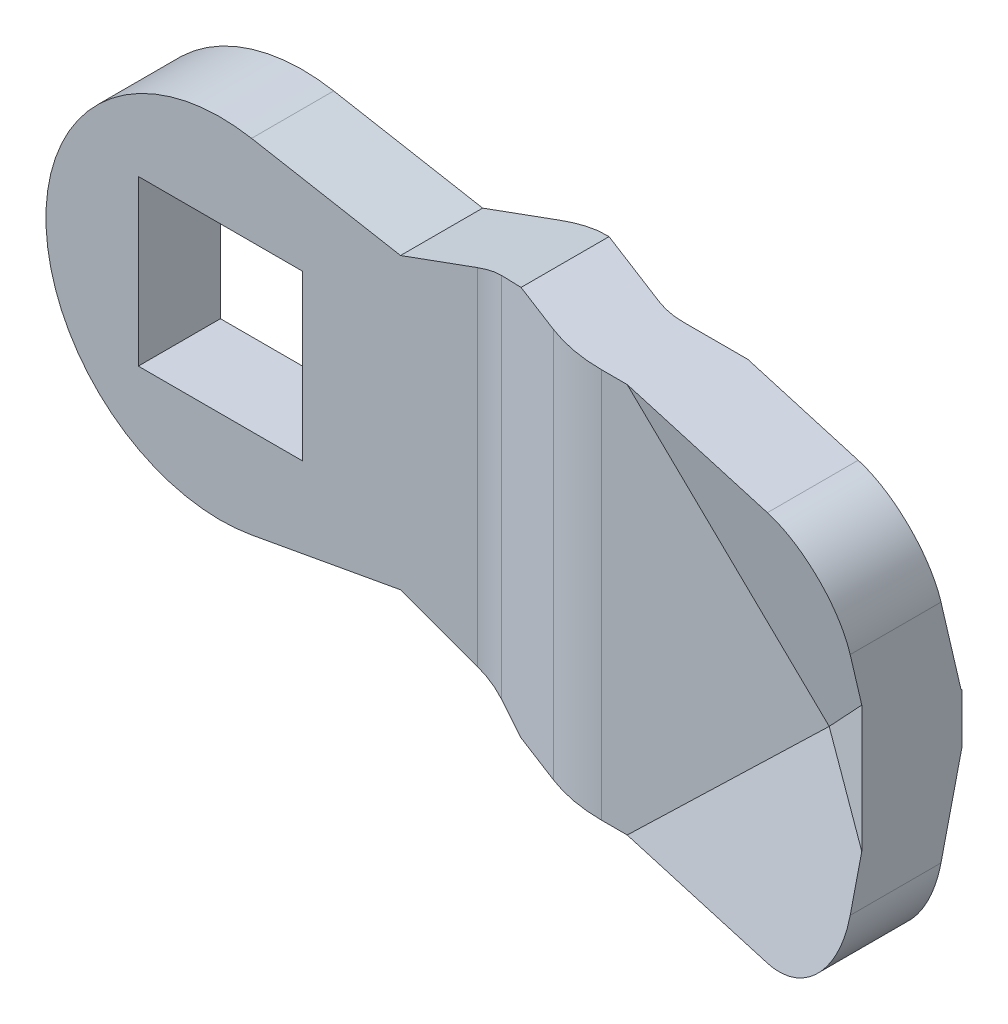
ISO-10303-21;
HEADER;
FILE_DESCRIPTION(('STEP AP214'),'2;1');
FILE_NAME('part.step','',(''),(''),'','','');
FILE_SCHEMA(('AUTOMOTIVE_DESIGN { 1 0 10303 214 1 1 1 1 }'));
ENDSEC;
DATA;
#1=APPLICATION_CONTEXT('core data for automotive mechanical design processes');
#2=APPLICATION_PROTOCOL_DEFINITION('international standard','automotive_design',2000,#1);
#3=PRODUCT_CONTEXT('',#1,'mechanical');
#4=PRODUCT('Part','Part','',(#3));
#5=PRODUCT_RELATED_PRODUCT_CATEGORY('part','',(#4));
#6=PRODUCT_DEFINITION_FORMATION('','',#4);
#7=PRODUCT_DEFINITION_CONTEXT('part definition',#1,'design');
#8=PRODUCT_DEFINITION('design','',#6,#7);
#9=PRODUCT_DEFINITION_SHAPE('','',#8);
#10=(LENGTH_UNIT() NAMED_UNIT(*) SI_UNIT(.MILLI.,.METRE.));
#11=(NAMED_UNIT(*) PLANE_ANGLE_UNIT() SI_UNIT($,.RADIAN.));
#12=(NAMED_UNIT(*) SI_UNIT($,.STERADIAN.) SOLID_ANGLE_UNIT());
#13=UNCERTAINTY_MEASURE_WITH_UNIT(LENGTH_MEASURE(1.E-05),#10,'distance_accuracy_value','');
#14=(GEOMETRIC_REPRESENTATION_CONTEXT(3) GLOBAL_UNCERTAINTY_ASSIGNED_CONTEXT((#13)) GLOBAL_UNIT_ASSIGNED_CONTEXT((#10,
#11,#12)) REPRESENTATION_CONTEXT('',''));
#15=CARTESIAN_POINT('',(0.,0.,0.));
#16=DIRECTION('',(0.,0.,1.));
#17=DIRECTION('',(1.,0.,0.));
#18=AXIS2_PLACEMENT_3D('',#15,#16,#17);
#19=CARTESIAN_POINT('',(6.5,2.8,-2.4));
#20=DIRECTION('',(0.,-1.,0.));
#21=DIRECTION('',(-1.,0.,0.));
#22=AXIS2_PLACEMENT_3D('',#19,#20,#21);
#23=PLANE('',#22);
#24=DIRECTION('',(0.707106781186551,0.,0.707106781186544));
#25=VECTOR('',#24,1.);
#26=CARTESIAN_POINT('',(7.5,2.8,-3.4));
#27=LINE('',#26,#25);
#28=CARTESIAN_POINT('',(8.5,2.8,-2.4));
#29=VERTEX_POINT('',#28);
#30=CARTESIAN_POINT('',(10.5,2.8,-0.400000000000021));
#31=VERTEX_POINT('',#30);
#32=EDGE_CURVE('E227',#29,#31,#27,.T.);
#33=ORIENTED_EDGE('',*,*,#32,.F.);
#34=DIRECTION('',(1.,0.,0.));
#35=VECTOR('',#34,1.);
#36=CARTESIAN_POINT('',(6.5,2.8,-2.4));
#37=LINE('',#36,#35);
#38=CARTESIAN_POINT('',(6.5,2.8,-2.4));
#39=VERTEX_POINT('',#38);
#40=EDGE_CURVE('E250',#39,#29,#37,.T.);
#41=ORIENTED_EDGE('',*,*,#40,.F.);
#42=DIRECTION('',(0.,0.,1.));
#43=VECTOR('',#42,1.);
#44=CARTESIAN_POINT('',(6.5,2.8,-2.4));
#45=LINE('',#44,#43);
#46=CARTESIAN_POINT('',(6.5,2.8,0.));
#47=VERTEX_POINT('',#46);
#48=EDGE_CURVE('E248',#39,#47,#45,.T.);
#49=ORIENTED_EDGE('',*,*,#48,.T.);
#50=DIRECTION('',(1.,0.,0.));
#51=VECTOR('',#50,1.);
#52=CARTESIAN_POINT('',(6.5,2.8,0.));
#53=LINE('',#52,#51);
#54=CARTESIAN_POINT('',(10.5,2.8,0.));
#55=VERTEX_POINT('',#54);
#56=EDGE_CURVE('E898',#47,#55,#53,.T.);
#57=ORIENTED_EDGE('',*,*,#56,.T.);
#58=DIRECTION('',(0.,0.,1.));
#59=VECTOR('',#58,1.);
#60=CARTESIAN_POINT('',(10.5,2.8,-2.4));
#61=LINE('',#60,#59);
#62=EDGE_CURVE('E245',#31,#55,#61,.T.);
#63=ORIENTED_EDGE('',*,*,#62,.F.);
#64=EDGE_LOOP('',(#33,#41,#49,#57,#63));
#65=FACE_BOUND('',#64,.T.);
#66=ADVANCED_FACE('F14',(#65),#23,.F.);
#67=CARTESIAN_POINT('',(10.5,-2.8,-2.4));
#68=DIRECTION('',(1.,0.,0.));
#69=DIRECTION('',(0.,-1.,0.));
#70=AXIS2_PLACEMENT_3D('',#67,#68,#69);
#71=PLANE('',#70);
#72=DIRECTION('',(0.,0.,1.));
#73=VECTOR('',#72,1.);
#74=CARTESIAN_POINT('',(10.5,-2.8,-2.4));
#75=LINE('',#74,#73);
#76=CARTESIAN_POINT('',(10.5,-2.8,-0.400000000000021));
#77=VERTEX_POINT('',#76);
#78=CARTESIAN_POINT('',(10.5,-2.8,0.));
#79=VERTEX_POINT('',#78);
#80=EDGE_CURVE('E237',#77,#79,#75,.T.);
#81=ORIENTED_EDGE('',*,*,#80,.F.);
#82=DIRECTION('',(0.,-1.,0.));
#83=VECTOR('',#82,1.);
#84=CARTESIAN_POINT('',(10.5,9.5,-0.400000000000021));
#85=LINE('',#84,#83);
#86=EDGE_CURVE('E224',#31,#77,#85,.T.);
#87=ORIENTED_EDGE('',*,*,#86,.F.);
#88=ORIENTED_EDGE('',*,*,#62,.T.);
#89=DIRECTION('',(0.,1.,0.));
#90=VECTOR('',#89,1.);
#91=CARTESIAN_POINT('',(10.5,-2.8,0.));
#92=LINE('',#91,#90);
#93=EDGE_CURVE('E244',#79,#55,#92,.T.);
#94=ORIENTED_EDGE('',*,*,#93,.F.);
#95=EDGE_LOOP('',(#81,#87,#88,#94));
#96=FACE_BOUND('',#95,.T.);
#97=ADVANCED_FACE('F242',(#96),#71,.T.);
#98=CARTESIAN_POINT('',(10.5,-2.8,-2.4));
#99=DIRECTION('',(0.,1.,0.));
#100=DIRECTION('',(1.,0.,0.));
#101=AXIS2_PLACEMENT_3D('',#98,#99,#100);
#102=PLANE('',#101);
#103=DIRECTION('',(0.707106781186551,0.,0.707106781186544));
#104=VECTOR('',#103,1.);
#105=CARTESIAN_POINT('',(8.5,-2.8,-2.4));
#106=LINE('',#105,#104);
#107=CARTESIAN_POINT('',(8.5,-2.8,-2.4));
#108=VERTEX_POINT('',#107);
#109=EDGE_CURVE('E29',#108,#77,#106,.T.);
#110=ORIENTED_EDGE('',*,*,#109,.T.);
#111=ORIENTED_EDGE('',*,*,#80,.T.);
#112=DIRECTION('',(-1.,0.,0.));
#113=VECTOR('',#112,1.);
#114=CARTESIAN_POINT('',(10.5,-2.8,0.));
#115=LINE('',#114,#113);
#116=CARTESIAN_POINT('',(6.5,-2.8,0.));
#117=VERTEX_POINT('',#116);
#118=EDGE_CURVE('E904',#79,#117,#115,.T.);
#119=ORIENTED_EDGE('',*,*,#118,.T.);
#120=DIRECTION('',(0.,0.,1.));
#121=VECTOR('',#120,1.);
#122=CARTESIAN_POINT('',(6.5,-2.8,-2.4));
#123=LINE('',#122,#121);
#124=CARTESIAN_POINT('',(6.5,-2.8,-2.4));
#125=VERTEX_POINT('',#124);
#126=EDGE_CURVE('E246',#125,#117,#123,.T.);
#127=ORIENTED_EDGE('',*,*,#126,.F.);
#128=DIRECTION('',(-1.,0.,0.));
#129=VECTOR('',#128,1.);
#130=CARTESIAN_POINT('',(10.5,-2.8,-2.4));
#131=LINE('',#130,#129);
#132=EDGE_CURVE('E239',#108,#125,#131,.T.);
#133=ORIENTED_EDGE('',*,*,#132,.F.);
#134=EDGE_LOOP('',(#110,#111,#119,#127,#133));
#135=FACE_BOUND('',#134,.T.);
#136=ADVANCED_FACE('F235',(#135),#102,.F.);
#137=CARTESIAN_POINT('',(6.5,-2.8,-2.4));
#138=DIRECTION('',(0.,0.,-1.));
#139=DIRECTION('',(0.,-1.,0.));
#140=AXIS2_PLACEMENT_3D('',#137,#138,#139);
#141=PLANE('',#140);
#142=ORIENTED_EDGE('',*,*,#40,.T.);
#143=DIRECTION('',(0.,-1.,0.));
#144=VECTOR('',#143,1.);
#145=CARTESIAN_POINT('',(8.5,9.5,-2.4));
#146=LINE('',#145,#144);
#147=EDGE_CURVE('E231',#29,#108,#146,.T.);
#148=ORIENTED_EDGE('',*,*,#147,.T.);
#149=ORIENTED_EDGE('',*,*,#132,.T.);
#150=DIRECTION('',(0.,-1.,0.));
#151=VECTOR('',#150,1.);
#152=CARTESIAN_POINT('',(6.5,2.8,-2.4));
#153=LINE('',#152,#151);
#154=EDGE_CURVE('E894',#39,#125,#153,.T.);
#155=ORIENTED_EDGE('',*,*,#154,.F.);
#156=EDGE_LOOP('',(#142,#148,#149,#155));
#157=FACE_BOUND('',#156,.T.);
#158=ADVANCED_FACE('F660',(#157),#141,.T.);
#159=CARTESIAN_POINT('',(0.,-9.5,4.));
#160=DIRECTION('',(0.,0.,-1.));
#161=DIRECTION('',(0.,-1.,0.));
#162=AXIS2_PLACEMENT_3D('',#159,#160,#161);
#163=PLANE('',#162);
#164=DIRECTION('',(0.,-1.,0.));
#165=VECTOR('',#164,1.);
#166=CARTESIAN_POINT('',(-4.,-9.5,4.));
#167=LINE('',#166,#165);
#168=CARTESIAN_POINT('',(-4.,4.,4.));
#169=VERTEX_POINT('',#168);
#170=CARTESIAN_POINT('',(-4.,-4.,4.));
#171=VERTEX_POINT('',#170);
#172=EDGE_CURVE('E341',#169,#171,#167,.T.);
#173=ORIENTED_EDGE('',*,*,#172,.F.);
#174=DIRECTION('',(1.,0.,0.));
#175=VECTOR('',#174,1.);
#176=CARTESIAN_POINT('',(0.,4.,4.));
#177=LINE('',#176,#175);
#178=CARTESIAN_POINT('',(4.,4.,4.));
#179=VERTEX_POINT('',#178);
#180=EDGE_CURVE('E332',#169,#179,#177,.T.);
#181=ORIENTED_EDGE('',*,*,#180,.T.);
#182=DIRECTION('',(0.,1.,0.));
#183=VECTOR('',#182,1.);
#184=CARTESIAN_POINT('',(4.,-9.5,4.));
#185=LINE('',#184,#183);
#186=CARTESIAN_POINT('',(4.,-4.,4.));
#187=VERTEX_POINT('',#186);
#188=EDGE_CURVE('E335',#187,#179,#185,.T.);
#189=ORIENTED_EDGE('',*,*,#188,.F.);
#190=DIRECTION('',(-1.,0.,0.));
#191=VECTOR('',#190,1.);
#192=CARTESIAN_POINT('',(0.,-4.,4.));
#193=LINE('',#192,#191);
#194=EDGE_CURVE('E338',#187,#171,#193,.T.);
#195=ORIENTED_EDGE('',*,*,#194,.T.);
#196=EDGE_LOOP('',(#173,#181,#189,#195));
#197=FACE_BOUND('',#196,.T.);
#198=DIRECTION('',(0.939692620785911,0.342020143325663,0.));
#199=VECTOR('',#198,1.);
#200=CARTESIAN_POINT('',(-4.29317235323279,2.29539409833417,4.));
#201=LINE('',#200,#199);
#202=CARTESIAN_POINT('',(8.77,7.05,4.));
#203=VERTEX_POINT('',#202);
#204=CARTESIAN_POINT('',(12.5172876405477,8.41390116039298,4.));
#205=VERTEX_POINT('',#204);
#206=EDGE_CURVE('E302',#203,#205,#201,.T.);
#207=ORIENTED_EDGE('',*,*,#206,.F.);
#208=DIRECTION('',(-0.98399365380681,0.178203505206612,0.));
#209=VECTOR('',#208,1.);
#210=CARTESIAN_POINT('',(3.18056541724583,8.06225940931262,4.));
#211=LINE('',#210,#209);
#212=CARTESIAN_POINT('',(1.5147297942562,8.36394605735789,4.));
#213=VERTEX_POINT('',#212);
#214=EDGE_CURVE('E306',#203,#213,#211,.T.);
#215=ORIENTED_EDGE('',*,*,#214,.T.);
#216=CARTESIAN_POINT('',(0.,0.,4.));
#217=DIRECTION('',(0.,0.,-1.));
#218=DIRECTION('',(0.,-1.,0.));
#219=AXIS2_PLACEMENT_3D('',#216,#217,#218);
#220=CIRCLE('',#219,8.5);
#221=CARTESIAN_POINT('',(1.5147297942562,-8.36394605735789,4.));
#222=VERTEX_POINT('',#221);
#223=EDGE_CURVE('E304',#222,#213,#220,.T.);
#224=ORIENTED_EDGE('',*,*,#223,.F.);
#225=DIRECTION('',(-0.98399365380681,-0.178203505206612,0.));
#226=VECTOR('',#225,1.);
#227=CARTESIAN_POINT('',(-0.151105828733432,-8.66563270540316,4.));
#228=LINE('',#227,#226);
#229=CARTESIAN_POINT('',(8.77,-7.05,4.));
#230=VERTEX_POINT('',#229);
#231=EDGE_CURVE('E309',#230,#222,#228,.T.);
#232=ORIENTED_EDGE('',*,*,#231,.F.);
#233=DIRECTION('',(0.939692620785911,-0.342020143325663,0.));
#234=VECTOR('',#233,1.);
#235=CARTESIAN_POINT('',(1.81330993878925,-4.51797188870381,4.));
#236=LINE('',#235,#234);
#237=CARTESIAN_POINT('',(12.5172876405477,-8.41390116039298,4.));
#238=VERTEX_POINT('',#237);
#239=EDGE_CURVE('E288',#230,#238,#236,.T.);
#240=ORIENTED_EDGE('',*,*,#239,.T.);
#241=DIRECTION('',(0.,1.,0.));
#242=VECTOR('',#241,1.);
#243=CARTESIAN_POINT('',(12.5172876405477,-9.5,4.));
#244=LINE('',#243,#242);
#245=EDGE_CURVE('E436',#238,#205,#244,.T.);
#246=ORIENTED_EDGE('',*,*,#245,.T.);
#247=EDGE_LOOP('',(#207,#215,#224,#232,#240,#246));
#248=FACE_BOUND('',#247,.T.);
#249=ADVANCED_FACE('F553',(#197,#248),#163,.F.);
#250=CARTESIAN_POINT('',(0.,-9.5,0.));
#251=DIRECTION('',(0.,0.,1.));
#252=DIRECTION('',(0.,1.,0.));
#253=AXIS2_PLACEMENT_3D('',#250,#251,#252);
#254=PLANE('',#253);
#255=ORIENTED_EDGE('',*,*,#56,.F.);
#256=DIRECTION('',(0.,-1.,0.));
#257=VECTOR('',#256,1.);
#258=CARTESIAN_POINT('',(6.5,2.8,0.));
#259=LINE('',#258,#257);
#260=EDGE_CURVE('E37',#47,#117,#259,.T.);
#261=ORIENTED_EDGE('',*,*,#260,.T.);
#262=ORIENTED_EDGE('',*,*,#118,.F.);
#263=ORIENTED_EDGE('',*,*,#93,.T.);
#264=EDGE_LOOP('',(#255,#261,#262,#263));
#265=FACE_BOUND('',#264,.T.);
#266=DIRECTION('',(0.,-1.,0.));
#267=VECTOR('',#266,1.);
#268=CARTESIAN_POINT('',(-4.,4.,0.));
#269=LINE('',#268,#267);
#270=CARTESIAN_POINT('',(-4.,4.,0.));
#271=VERTEX_POINT('',#270);
#272=CARTESIAN_POINT('',(-4.,-4.,0.));
#273=VERTEX_POINT('',#272);
#274=EDGE_CURVE('E311',#271,#273,#269,.T.);
#275=ORIENTED_EDGE('',*,*,#274,.T.);
#276=DIRECTION('',(-1.,0.,0.));
#277=VECTOR('',#276,1.);
#278=CARTESIAN_POINT('',(4.,-4.,0.));
#279=LINE('',#278,#277);
#280=CARTESIAN_POINT('',(4.,-4.,0.));
#281=VERTEX_POINT('',#280);
#282=EDGE_CURVE('E314',#281,#273,#279,.T.);
#283=ORIENTED_EDGE('',*,*,#282,.F.);
#284=DIRECTION('',(0.,1.,0.));
#285=VECTOR('',#284,1.);
#286=CARTESIAN_POINT('',(4.,-4.,0.));
#287=LINE('',#286,#285);
#288=CARTESIAN_POINT('',(4.,4.,0.));
#289=VERTEX_POINT('',#288);
#290=EDGE_CURVE('E317',#281,#289,#287,.T.);
#291=ORIENTED_EDGE('',*,*,#290,.T.);
#292=DIRECTION('',(1.,0.,0.));
#293=VECTOR('',#292,1.);
#294=CARTESIAN_POINT('',(-4.,4.,0.));
#295=LINE('',#294,#293);
#296=EDGE_CURVE('E320',#271,#289,#295,.T.);
#297=ORIENTED_EDGE('',*,*,#296,.F.);
#298=EDGE_LOOP('',(#275,#283,#291,#297));
#299=FACE_BOUND('',#298,.T.);
#300=DIRECTION('',(0.,1.,0.));
#301=VECTOR('',#300,1.);
#302=CARTESIAN_POINT('',(12.5172876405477,-9.5,0.));
#303=LINE('',#302,#301);
#304=CARTESIAN_POINT('',(12.5172876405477,-8.41390116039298,0.));
#305=VERTEX_POINT('',#304);
#306=CARTESIAN_POINT('',(12.5172876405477,8.41390116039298,0.));
#307=VERTEX_POINT('',#306);
#308=EDGE_CURVE('E433',#305,#307,#303,.T.);
#309=ORIENTED_EDGE('',*,*,#308,.F.);
#310=DIRECTION('',(0.93969262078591,-0.342020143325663,0.));
#311=VECTOR('',#310,1.);
#312=CARTESIAN_POINT('',(8.77,-7.05,0.));
#313=LINE('',#312,#311);
#314=CARTESIAN_POINT('',(8.77,-7.05,0.));
#315=VERTEX_POINT('',#314);
#316=EDGE_CURVE('E259',#315,#305,#313,.T.);
#317=ORIENTED_EDGE('',*,*,#316,.F.);
#318=DIRECTION('',(-0.98399365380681,-0.178203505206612,0.));
#319=VECTOR('',#318,1.);
#320=CARTESIAN_POINT('',(8.77,-7.05,0.));
#321=LINE('',#320,#319);
#322=CARTESIAN_POINT('',(1.5147297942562,-8.36394605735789,0.));
#323=VERTEX_POINT('',#322);
#324=EDGE_CURVE('E261',#315,#323,#321,.T.);
#325=ORIENTED_EDGE('',*,*,#324,.T.);
#326=CARTESIAN_POINT('',(0.,0.,0.));
#327=DIRECTION('',(0.,0.,-1.));
#328=DIRECTION('',(0.,-1.,0.));
#329=AXIS2_PLACEMENT_3D('',#326,#327,#328);
#330=CIRCLE('',#329,8.5);
#331=CARTESIAN_POINT('',(1.5147297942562,8.36394605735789,0.));
#332=VERTEX_POINT('',#331);
#333=EDGE_CURVE('E264',#323,#332,#330,.T.);
#334=ORIENTED_EDGE('',*,*,#333,.T.);
#335=DIRECTION('',(-0.98399365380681,0.178203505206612,0.));
#336=VECTOR('',#335,1.);
#337=CARTESIAN_POINT('',(8.77,7.05,0.));
#338=LINE('',#337,#336);
#339=CARTESIAN_POINT('',(8.77,7.05,0.));
#340=VERTEX_POINT('',#339);
#341=EDGE_CURVE('E266',#340,#332,#338,.T.);
#342=ORIENTED_EDGE('',*,*,#341,.F.);
#343=DIRECTION('',(0.93969262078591,0.342020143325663,0.));
#344=VECTOR('',#343,1.);
#345=CARTESIAN_POINT('',(8.77,7.05,0.));
#346=LINE('',#345,#344);
#347=EDGE_CURVE('E256',#340,#307,#346,.T.);
#348=ORIENTED_EDGE('',*,*,#347,.T.);
#349=EDGE_LOOP('',(#309,#317,#325,#334,#342,#348));
#350=FACE_BOUND('',#349,.T.);
#351=ADVANCED_FACE('F567',(#265,#299,#350),#254,.F.);
#352=CARTESIAN_POINT('',(20.9213561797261,9.5,-1.62772026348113));
#353=DIRECTION('',(0.,1.,0.));
#354=DIRECTION('',(1.,0.,0.));
#355=AXIS2_PLACEMENT_3D('',#352,#353,#354);
#356=PLANE('',#355);
#357=DIRECTION('',(-0.975461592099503,0.,-0.220169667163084));
#358=VECTOR('',#357,1.);
#359=CARTESIAN_POINT('',(45.4425723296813,9.5,11.6224061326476));
#360=LINE('',#359,#358);
#361=CARTESIAN_POINT('',(31.,9.5,8.36259932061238));
#362=VERTEX_POINT('',#361);
#363=CARTESIAN_POINT('',(22.1818901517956,9.5,6.37227973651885));
#364=VERTEX_POINT('',#363);
#365=EDGE_CURVE('E375',#362,#364,#360,.T.);
#366=ORIENTED_EDGE('',*,*,#365,.F.);
#367=DIRECTION('',(0.,0.,-1.));
#368=VECTOR('',#367,1.);
#369=CARTESIAN_POINT('',(31.,9.5,-1.62772026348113));
#370=LINE('',#369,#368);
#371=CARTESIAN_POINT('',(31.,9.5,3.94030808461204));
#372=VERTEX_POINT('',#371);
#373=EDGE_CURVE('E465',#362,#372,#370,.T.);
#374=ORIENTED_EDGE('',*,*,#373,.T.);
#375=DIRECTION('',(0.975461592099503,0.,0.220169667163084));
#376=VECTOR('',#375,1.);
#377=CARTESIAN_POINT('',(37.9528669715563,9.5,5.5096270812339));
#378=LINE('',#377,#376);
#379=CARTESIAN_POINT('',(24.0528512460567,9.5,2.37227973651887));
#380=VERTEX_POINT('',#379);
#381=EDGE_CURVE('E372',#380,#372,#378,.T.);
#382=ORIENTED_EDGE('',*,*,#381,.F.);
#383=DIRECTION('',(1.,0.,0.));
#384=VECTOR('',#383,1.);
#385=CARTESIAN_POINT('',(20.9213561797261,9.5,2.37227973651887));
#386=LINE('',#385,#384);
#387=CARTESIAN_POINT('',(20.9213561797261,9.5,2.37227973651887));
#388=VERTEX_POINT('',#387);
#389=EDGE_CURVE('E393',#388,#380,#386,.T.);
#390=ORIENTED_EDGE('',*,*,#389,.F.);
#391=CARTESIAN_POINT('',(20.9213561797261,9.5,-1.62772026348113));
#392=DIRECTION('',(0.,1.,0.));
#393=DIRECTION('',(1.,0.,0.));
#394=AXIS2_PLACEMENT_3D('',#391,#392,#393);
#395=CIRCLE('',#394,4.);
#396=CARTESIAN_POINT('',(19.487884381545,9.5,2.10660144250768));
#397=VERTEX_POINT('',#396);
#398=EDGE_CURVE('E396',#397,#388,#395,.T.);
#399=ORIENTED_EDGE('',*,*,#398,.F.);
#400=DIRECTION('',(0.933580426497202,0.,0.358367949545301));
#401=VECTOR('',#400,1.);
#402=CARTESIAN_POINT('',(15.3842312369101,9.5,0.531356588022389));
#403=LINE('',#402,#401);
#404=CARTESIAN_POINT('',(15.5013196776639,9.5,0.576302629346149));
#405=VERTEX_POINT('',#404);
#406=EDGE_CURVE('E399',#405,#397,#403,.T.);
#407=ORIENTED_EDGE('',*,*,#406,.F.);
#408=DIRECTION('',(0.,0.,1.));
#409=VECTOR('',#408,1.);
#410=CARTESIAN_POINT('',(15.5013196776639,9.5,-1.62772026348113));
#411=LINE('',#410,#409);
#412=CARTESIAN_POINT('',(15.5013196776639,9.5,4.86088260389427));
#413=VERTEX_POINT('',#412);
#414=EDGE_CURVE('E293',#405,#413,#411,.T.);
#415=ORIENTED_EDGE('',*,*,#414,.T.);
#416=DIRECTION('',(0.933580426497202,0.,0.358367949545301));
#417=VECTOR('',#416,1.);
#418=CARTESIAN_POINT('',(13.9507594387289,9.5,4.2656782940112));
#419=LINE('',#418,#417);
#420=CARTESIAN_POINT('',(18.0544125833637,9.5,5.84092314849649));
#421=VERTEX_POINT('',#420);
#422=EDGE_CURVE('E401',#413,#421,#419,.T.);
#423=ORIENTED_EDGE('',*,*,#422,.T.);
#424=CARTESIAN_POINT('',(20.9213561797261,9.5,-1.62772026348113));
#425=DIRECTION('',(0.,-1.,0.));
#426=DIRECTION('',(-1.,0.,0.));
#427=AXIS2_PLACEMENT_3D('',#424,#425,#426);
#428=CIRCLE('',#427,8.);
#429=CARTESIAN_POINT('',(20.9213561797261,9.5,6.37227973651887));
#430=VERTEX_POINT('',#429);
#431=EDGE_CURVE('E403',#421,#430,#428,.F.);
#432=ORIENTED_EDGE('',*,*,#431,.T.);
#433=DIRECTION('',(-1.,0.,0.));
#434=VECTOR('',#433,1.);
#435=CARTESIAN_POINT('',(20.9213561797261,9.5,6.37227973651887));
#436=LINE('',#435,#434);
#437=EDGE_CURVE('E406',#430,#364,#436,.F.);
#438=ORIENTED_EDGE('',*,*,#437,.T.);
#439=EDGE_LOOP('',(#366,#374,#382,#390,#399,#407,#415,#423,#432,#438));
#440=FACE_BOUND('',#439,.T.);
#441=ADVANCED_FACE('F485',(#440),#356,.T.);
#442=CARTESIAN_POINT('',(13.9507594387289,-9.5,4.2656782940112));
#443=DIRECTION('',(-0.358367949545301,0.,0.933580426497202));
#444=DIRECTION('',(-0.933580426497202,0.,-0.358367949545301));
#445=AXIS2_PLACEMENT_3D('',#442,#443,#444);
#446=PLANE('',#445);
#447=ORIENTED_EDGE('',*,*,#422,.F.);
#448=DIRECTION('',(-0.883943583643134,-0.321729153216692,-0.339314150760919));
#449=VECTOR('',#448,1.);
#450=CARTESIAN_POINT('',(8.70783939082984,7.02737538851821,2.25310984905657));
#451=LINE('',#450,#449);
#452=CARTESIAN_POINT('',(13.9507594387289,8.93564222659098,4.2656782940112));
#453=VERTEX_POINT('',#452);
#454=EDGE_CURVE('E296',#413,#453,#451,.T.);
#455=ORIENTED_EDGE('',*,*,#454,.T.);
#456=DIRECTION('',(0.,1.,0.));
#457=VECTOR('',#456,1.);
#458=CARTESIAN_POINT('',(13.9507594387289,-9.5,4.2656782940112));
#459=LINE('',#458,#457);
#460=CARTESIAN_POINT('',(13.9507594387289,-8.93564222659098,4.2656782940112));
#461=VERTEX_POINT('',#460);
#462=EDGE_CURVE('E439',#461,#453,#459,.T.);
#463=ORIENTED_EDGE('',*,*,#462,.F.);
#464=DIRECTION('',(-0.883943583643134,0.321729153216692,-0.339314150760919));
#465=VECTOR('',#464,1.);
#466=CARTESIAN_POINT('',(14.1112573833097,-8.99405870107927,4.32728768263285));
#467=LINE('',#466,#465);
#468=CARTESIAN_POINT('',(15.5013196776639,-9.5,4.86088260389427));
#469=VERTEX_POINT('',#468);
#470=EDGE_CURVE('E284',#469,#461,#467,.T.);
#471=ORIENTED_EDGE('',*,*,#470,.F.);
#472=DIRECTION('',(0.933580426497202,0.,0.358367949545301));
#473=VECTOR('',#472,1.);
#474=CARTESIAN_POINT('',(13.9507594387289,-9.5,4.2656782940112));
#475=LINE('',#474,#473);
#476=CARTESIAN_POINT('',(18.0544125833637,-9.5,5.84092314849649));
#477=VERTEX_POINT('',#476);
#478=EDGE_CURVE('E417',#469,#477,#475,.T.);
#479=ORIENTED_EDGE('',*,*,#478,.T.);
#480=DIRECTION('',(0.,1.,0.));
#481=VECTOR('',#480,1.);
#482=CARTESIAN_POINT('',(18.0544125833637,-9.5,5.84092314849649));
#483=LINE('',#482,#481);
#484=EDGE_CURVE('E442',#477,#421,#483,.T.);
#485=ORIENTED_EDGE('',*,*,#484,.T.);
#486=EDGE_LOOP('',(#447,#455,#463,#471,#479,#485));
#487=FACE_BOUND('',#486,.T.);
#488=ADVANCED_FACE('F532',(#487),#446,.T.);
#489=CARTESIAN_POINT('',(12.5172876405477,-9.5,8.));
#490=DIRECTION('',(0.,1.,0.));
#491=DIRECTION('',(1.,0.,0.));
#492=AXIS2_PLACEMENT_3D('',#489,#490,#491);
#493=CYLINDRICAL_SURFACE('',#492,4.);
#494=ORIENTED_EDGE('',*,*,#462,.T.);
#495=CARTESIAN_POINT('',(12.5172876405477,8.41390116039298,8.));
#496=DIRECTION('',(-0.342020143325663,0.93969262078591,0.));
#497=DIRECTION('',(0.939692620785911,0.342020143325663,0.));
#498=AXIS2_PLACEMENT_3D('',#495,#496,#497);
#499=ELLIPSE('',#498,4.25671108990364,4.);
#500=EDGE_CURVE('E299',#453,#205,#499,.T.);
#501=ORIENTED_EDGE('',*,*,#500,.T.);
#502=ORIENTED_EDGE('',*,*,#245,.F.);
#503=CARTESIAN_POINT('',(12.5172876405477,-8.41390116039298,8.));
#504=DIRECTION('',(0.342020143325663,0.93969262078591,0.));
#505=DIRECTION('',(-0.939692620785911,0.342020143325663,0.));
#506=AXIS2_PLACEMENT_3D('',#503,#504,#505);
#507=ELLIPSE('',#506,4.25671108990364,4.);
#508=EDGE_CURVE('E286',#461,#238,#507,.T.);
#509=ORIENTED_EDGE('',*,*,#508,.F.);
#510=EDGE_LOOP('',(#494,#501,#502,#509));
#511=FACE_BOUND('',#510,.T.);
#512=ADVANCED_FACE('F547',(#511),#493,.F.);
#513=CARTESIAN_POINT('',(12.5172876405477,-9.5,8.));
#514=DIRECTION('',(0.,1.,0.));
#515=DIRECTION('',(1.,0.,0.));
#516=AXIS2_PLACEMENT_3D('',#513,#514,#515);
#517=CYLINDRICAL_SURFACE('',#516,8.);
#518=CARTESIAN_POINT('',(12.5172876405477,8.41390116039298,8.));
#519=DIRECTION('',(-0.342020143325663,0.93969262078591,0.));
#520=DIRECTION('',(0.939692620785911,0.342020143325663,0.));
#521=AXIS2_PLACEMENT_3D('',#518,#519,#520);
#522=ELLIPSE('',#521,8.51342217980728,8.);
#523=CARTESIAN_POINT('',(15.3842312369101,9.45738329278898,0.531356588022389));
#524=VERTEX_POINT('',#523);
#525=EDGE_CURVE('E291',#524,#307,#522,.T.);
#526=ORIENTED_EDGE('',*,*,#525,.F.);
#527=DIRECTION('',(0.,1.,0.));
#528=VECTOR('',#527,1.);
#529=CARTESIAN_POINT('',(15.3842312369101,-9.5,0.531356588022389));
#530=LINE('',#529,#528);
#531=CARTESIAN_POINT('',(15.3842312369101,-9.45738329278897,0.531356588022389));
#532=VERTEX_POINT('',#531);
#533=EDGE_CURVE('E430',#532,#524,#530,.T.);
#534=ORIENTED_EDGE('',*,*,#533,.F.);
#535=CARTESIAN_POINT('',(12.5172876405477,-8.41390116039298,8.));
#536=DIRECTION('',(0.342020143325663,0.93969262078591,0.));
#537=DIRECTION('',(-0.939692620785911,0.342020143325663,0.));
#538=AXIS2_PLACEMENT_3D('',#535,#536,#537);
#539=ELLIPSE('',#538,8.51342217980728,8.);
#540=EDGE_CURVE('E278',#532,#305,#539,.T.);
#541=ORIENTED_EDGE('',*,*,#540,.T.);
#542=ORIENTED_EDGE('',*,*,#308,.T.);
#543=EDGE_LOOP('',(#526,#534,#541,#542));
#544=FACE_BOUND('',#543,.T.);
#545=ADVANCED_FACE('F571',(#544),#517,.T.);
#546=CARTESIAN_POINT('',(15.3842312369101,-9.5,0.531356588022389));
#547=DIRECTION('',(-0.358367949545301,0.,0.933580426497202));
#548=DIRECTION('',(-0.933580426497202,0.,-0.358367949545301));
#549=AXIS2_PLACEMENT_3D('',#546,#547,#548);
#550=PLANE('',#549);
#551=DIRECTION('',(-0.883943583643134,-0.321729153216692,-0.339314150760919));
#552=VECTOR('',#551,1.);
#553=CARTESIAN_POINT('',(9.99293302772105,7.4951112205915,-1.53816889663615));
#554=LINE('',#553,#552);
#555=EDGE_CURVE('E452',#405,#524,#554,.T.);
#556=ORIENTED_EDGE('',*,*,#555,.F.);
#557=ORIENTED_EDGE('',*,*,#406,.T.);
#558=DIRECTION('',(0.,1.,0.));
#559=VECTOR('',#558,1.);
#560=CARTESIAN_POINT('',(19.487884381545,-9.5,2.10660144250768));
#561=LINE('',#560,#559);
#562=CARTESIAN_POINT('',(19.487884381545,-9.5,2.10660144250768));
#563=VERTEX_POINT('',#562);
#564=EDGE_CURVE('E427',#563,#397,#561,.T.);
#565=ORIENTED_EDGE('',*,*,#564,.F.);
#566=DIRECTION('',(0.933580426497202,0.,0.358367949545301));
#567=VECTOR('',#566,1.);
#568=CARTESIAN_POINT('',(15.3842312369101,-9.5,0.531356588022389));
#569=LINE('',#568,#567);
#570=CARTESIAN_POINT('',(15.5013196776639,-9.5,0.576302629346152));
#571=VERTEX_POINT('',#570);
#572=EDGE_CURVE('E415',#571,#563,#569,.T.);
#573=ORIENTED_EDGE('',*,*,#572,.F.);
#574=DIRECTION('',(-0.883943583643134,0.321729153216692,-0.339314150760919));
#575=VECTOR('',#574,1.);
#576=CARTESIAN_POINT('',(15.3963510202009,-9.46179453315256,0.536008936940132));
#577=LINE('',#576,#575);
#578=EDGE_CURVE('E449',#571,#532,#577,.T.);
#579=ORIENTED_EDGE('',*,*,#578,.T.);
#580=ORIENTED_EDGE('',*,*,#533,.T.);
#581=EDGE_LOOP('',(#556,#557,#565,#573,#579,#580));
#582=FACE_BOUND('',#581,.T.);
#583=ADVANCED_FACE('F528',(#582),#550,.F.);
#584=CARTESIAN_POINT('',(37.2660386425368,23.1826560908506,8.55261962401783));
#585=DIRECTION('',(0.214661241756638,0.222288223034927,-0.951056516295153));
#586=DIRECTION('',(0.,-0.973756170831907,-0.227593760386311));
#587=AXIS2_PLACEMENT_3D('',#584,#585,#586);
#588=PLANE('',#587);
#589=ORIENTED_EDGE('',*,*,#381,.T.);
#590=CARTESIAN_POINT('',(31.,5.5,3.00539740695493));
#591=DIRECTION('',(0.214661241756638,0.222288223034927,-0.951056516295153));
#592=DIRECTION('',(-0.660659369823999,-0.684132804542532,-0.309016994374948));
#593=AXIS2_PLACEMENT_3D('',#590,#591,#592);
#594=ELLIPSE('',#593,4.20584889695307,4.);
#595=CARTESIAN_POINT('',(35.,5.5,3.90823015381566));
#596=VERTEX_POINT('',#595);
#597=EDGE_CURVE('E22',#372,#596,#594,.T.);
#598=ORIENTED_EDGE('',*,*,#597,.T.);
#599=DIRECTION('',(0.,-0.973756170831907,-0.227593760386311));
#600=VECTOR('',#599,1.);
#601=CARTESIAN_POINT('',(35.,23.2960070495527,8.06764940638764));
#602=LINE('',#601,#600);
#603=CARTESIAN_POINT('',(35.,1.32449463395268,2.93229901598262));
#604=VERTEX_POINT('',#603);
#605=EDGE_CURVE('E351',#596,#604,#602,.T.);
#606=ORIENTED_EDGE('',*,*,#605,.T.);
#607=DIRECTION('',(-0.61089989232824,-0.729204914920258,-0.308320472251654));
#608=VECTOR('',#607,1.);
#609=CARTESIAN_POINT('',(46.6414680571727,15.2204141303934,8.80773454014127));
#610=LINE('',#609,#608);
#611=CARTESIAN_POINT('',(33.8903892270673,0.,2.37227973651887));
#612=VERTEX_POINT('',#611);
#613=EDGE_CURVE('E364',#604,#612,#610,.T.);
#614=ORIENTED_EDGE('',*,*,#613,.T.);
#615=DIRECTION('',(0.719339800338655,-0.694658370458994,0.));
#616=VECTOR('',#615,1.);
#617=CARTESIAN_POINT('',(31.9266727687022,1.89633894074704,2.37227973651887));
#618=LINE('',#617,#616);
#619=EDGE_CURVE('E387',#380,#612,#618,.T.);
#620=ORIENTED_EDGE('',*,*,#619,.F.);
#621=EDGE_LOOP('',(#589,#598,#606,#614,#620));
#622=FACE_BOUND('',#621,.T.);
#623=ADVANCED_FACE('F469',(#622),#588,.T.);
#624=CARTESIAN_POINT('',(45.2326155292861,13.6826560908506,12.5526196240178));
#625=DIRECTION('',(-0.214661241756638,-0.222288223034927,0.951056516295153));
#626=DIRECTION('',(0.,0.973756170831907,0.227593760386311));
#627=AXIS2_PLACEMENT_3D('',#624,#625,#626);
#628=PLANE('',#627);
#629=DIRECTION('',(0.,0.973756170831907,0.227593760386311));
#630=VECTOR('',#629,1.);
#631=CARTESIAN_POINT('',(35.,14.1945082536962,10.3626685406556));
#632=LINE('',#631,#630);
#633=CARTESIAN_POINT('',(35.,3.08647252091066,7.76641323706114));
#634=VERTEX_POINT('',#633);
#635=CARTESIAN_POINT('',(35.,5.5,8.33052138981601));
#636=VERTEX_POINT('',#635);
#637=EDGE_CURVE('E346',#634,#636,#632,.T.);
#638=ORIENTED_EDGE('',*,*,#637,.T.);
#639=CARTESIAN_POINT('',(31.,5.5,7.42768864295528));
#640=DIRECTION('',(-0.214661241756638,-0.222288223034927,0.951056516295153));
#641=DIRECTION('',(-0.660659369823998,-0.684132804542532,-0.309016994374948));
#642=AXIS2_PLACEMENT_3D('',#639,#640,#641);
#643=ELLIPSE('',#642,4.20584889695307,4.);
#644=EDGE_CURVE('E9',#636,#362,#643,.T.);
#645=ORIENTED_EDGE('',*,*,#644,.T.);
#646=ORIENTED_EDGE('',*,*,#365,.T.);
#647=DIRECTION('',(-0.719339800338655,0.694658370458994,0.));
#648=VECTOR('',#647,1.);
#649=CARTESIAN_POINT('',(33.5617242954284,-1.48937809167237,6.37227973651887));
#650=LINE('',#649,#648);
#651=CARTESIAN_POINT('',(32.0194281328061,0.,6.37227973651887));
#652=VERTEX_POINT('',#651);
#653=EDGE_CURVE('E381',#652,#364,#650,.T.);
#654=ORIENTED_EDGE('',*,*,#653,.F.);
#655=DIRECTION('',(0.660659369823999,0.684132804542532,0.309016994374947));
#656=VECTOR('',#655,1.);
#657=CARTESIAN_POINT('',(45.2326155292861,13.6826560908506,12.5526196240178));
#658=LINE('',#657,#656);
#659=EDGE_CURVE('E361',#652,#634,#658,.T.);
#660=ORIENTED_EDGE('',*,*,#659,.T.);
#661=EDGE_LOOP('',(#638,#645,#646,#654,#660));
#662=FACE_BOUND('',#661,.T.);
#663=ADVANCED_FACE('F482',(#662),#628,.T.);
#664=CARTESIAN_POINT('',(20.9213561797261,-9.5,-1.62772026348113));
#665=DIRECTION('',(0.,1.,0.));
#666=DIRECTION('',(1.,0.,0.));
#667=AXIS2_PLACEMENT_3D('',#664,#665,#666);
#668=PLANE('',#667);
#669=DIRECTION('',(-0.975461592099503,0.,-0.220169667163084));
#670=VECTOR('',#669,1.);
#671=CARTESIAN_POINT('',(37.9528669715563,-9.5,5.5096270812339));
#672=LINE('',#671,#670);
#673=CARTESIAN_POINT('',(31.,-9.5,3.94030808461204));
#674=VERTEX_POINT('',#673);
#675=CARTESIAN_POINT('',(24.0528512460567,-9.5,2.37227973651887));
#676=VERTEX_POINT('',#675);
#677=EDGE_CURVE('E367',#674,#676,#672,.T.);
#678=ORIENTED_EDGE('',*,*,#677,.F.);
#679=DIRECTION('',(0.,0.,-1.));
#680=VECTOR('',#679,1.);
#681=CARTESIAN_POINT('',(31.,-9.5,13.5619096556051));
#682=LINE('',#681,#680);
#683=CARTESIAN_POINT('',(31.,-9.5,8.36259932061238));
#684=VERTEX_POINT('',#683);
#685=EDGE_CURVE('E461',#674,#684,#682,.F.);
#686=ORIENTED_EDGE('',*,*,#685,.T.);
#687=DIRECTION('',(0.975461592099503,0.,0.220169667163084));
#688=VECTOR('',#687,1.);
#689=CARTESIAN_POINT('',(45.4425723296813,-9.5,11.6224061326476));
#690=LINE('',#689,#688);
#691=CARTESIAN_POINT('',(22.1818901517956,-9.5,6.37227973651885));
#692=VERTEX_POINT('',#691);
#693=EDGE_CURVE('E369',#692,#684,#690,.T.);
#694=ORIENTED_EDGE('',*,*,#693,.F.);
#695=DIRECTION('',(-1.,0.,0.));
#696=VECTOR('',#695,1.);
#697=CARTESIAN_POINT('',(20.9213561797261,-9.5,6.37227973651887));
#698=LINE('',#697,#696);
#699=CARTESIAN_POINT('',(20.9213561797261,-9.5,6.37227973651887));
#700=VERTEX_POINT('',#699);
#701=EDGE_CURVE('E422',#700,#692,#698,.F.);
#702=ORIENTED_EDGE('',*,*,#701,.F.);
#703=CARTESIAN_POINT('',(20.9213561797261,-9.5,-1.62772026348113));
#704=DIRECTION('',(0.,-1.,0.));
#705=DIRECTION('',(-1.,0.,0.));
#706=AXIS2_PLACEMENT_3D('',#703,#704,#705);
#707=CIRCLE('',#706,8.);
#708=EDGE_CURVE('E419',#477,#700,#707,.F.);
#709=ORIENTED_EDGE('',*,*,#708,.F.);
#710=ORIENTED_EDGE('',*,*,#478,.F.);
#711=DIRECTION('',(0.,0.,-1.));
#712=VECTOR('',#711,1.);
#713=CARTESIAN_POINT('',(15.5013196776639,-9.5,-1.62772026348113));
#714=LINE('',#713,#712);
#715=EDGE_CURVE('E281',#469,#571,#714,.T.);
#716=ORIENTED_EDGE('',*,*,#715,.T.);
#717=ORIENTED_EDGE('',*,*,#572,.T.);
#718=CARTESIAN_POINT('',(20.9213561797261,-9.5,-1.62772026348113));
#719=DIRECTION('',(0.,1.,0.));
#720=DIRECTION('',(1.,0.,0.));
#721=AXIS2_PLACEMENT_3D('',#718,#719,#720);
#722=CIRCLE('',#721,4.);
#723=CARTESIAN_POINT('',(20.9213561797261,-9.5,2.37227973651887));
#724=VERTEX_POINT('',#723);
#725=EDGE_CURVE('E412',#563,#724,#722,.T.);
#726=ORIENTED_EDGE('',*,*,#725,.T.);
#727=DIRECTION('',(1.,0.,0.));
#728=VECTOR('',#727,1.);
#729=CARTESIAN_POINT('',(20.9213561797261,-9.5,2.37227973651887));
#730=LINE('',#729,#728);
#731=EDGE_CURVE('E409',#724,#676,#730,.T.);
#732=ORIENTED_EDGE('',*,*,#731,.T.);
#733=EDGE_LOOP('',(#678,#686,#694,#702,#709,#710,#716,#717,#726,#732));
#734=FACE_BOUND('',#733,.T.);
#735=ADVANCED_FACE('F542',(#734),#668,.F.);
#736=CARTESIAN_POINT('',(45.2326155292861,-13.6826560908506,12.5526196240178));
#737=DIRECTION('',(0.214661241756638,-0.222288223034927,-0.951056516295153));
#738=DIRECTION('',(0.,-0.973756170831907,0.227593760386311));
#739=AXIS2_PLACEMENT_3D('',#736,#737,#738);
#740=PLANE('',#739);
#741=ORIENTED_EDGE('',*,*,#693,.T.);
#742=CARTESIAN_POINT('',(31.,-5.5,7.42768864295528));
#743=DIRECTION('',(0.214661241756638,-0.222288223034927,-0.951056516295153));
#744=DIRECTION('',(0.660659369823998,-0.684132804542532,0.309016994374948));
#745=AXIS2_PLACEMENT_3D('',#742,#743,#744);
#746=ELLIPSE('',#745,4.20584889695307,4.);
#747=CARTESIAN_POINT('',(35.,-5.5,8.33052138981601));
#748=VERTEX_POINT('',#747);
#749=EDGE_CURVE('E463',#684,#748,#746,.F.);
#750=ORIENTED_EDGE('',*,*,#749,.T.);
#751=DIRECTION('',(0.,-0.973756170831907,0.227593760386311));
#752=VECTOR('',#751,1.);
#753=CARTESIAN_POINT('',(35.,-14.1945082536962,10.3626685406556));
#754=LINE('',#753,#752);
#755=CARTESIAN_POINT('',(35.,-3.08647252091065,7.76641323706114));
#756=VERTEX_POINT('',#755);
#757=EDGE_CURVE('E343',#756,#748,#754,.T.);
#758=ORIENTED_EDGE('',*,*,#757,.F.);
#759=DIRECTION('',(-0.660659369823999,0.684132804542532,-0.309016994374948));
#760=VECTOR('',#759,1.);
#761=CARTESIAN_POINT('',(45.2326155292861,-13.6826560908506,12.5526196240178));
#762=LINE('',#761,#760);
#763=EDGE_CURVE('E377',#756,#652,#762,.T.);
#764=ORIENTED_EDGE('',*,*,#763,.T.);
#765=DIRECTION('',(0.719339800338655,0.694658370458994,0.));
#766=VECTOR('',#765,1.);
#767=CARTESIAN_POINT('',(33.5617242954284,1.48937809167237,6.37227973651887));
#768=LINE('',#767,#766);
#769=EDGE_CURVE('E384',#652,#692,#768,.F.);
#770=ORIENTED_EDGE('',*,*,#769,.T.);
#771=EDGE_LOOP('',(#741,#750,#758,#764,#770));
#772=FACE_BOUND('',#771,.T.);
#773=ADVANCED_FACE('F498',(#772),#740,.F.);
#774=CARTESIAN_POINT('',(37.2660386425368,-23.1826560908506,8.55261962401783));
#775=DIRECTION('',(-0.214661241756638,0.222288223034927,0.951056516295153));
#776=DIRECTION('',(0.,0.973756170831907,-0.227593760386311));
#777=AXIS2_PLACEMENT_3D('',#774,#775,#776);
#778=PLANE('',#777);
#779=DIRECTION('',(0.,0.973756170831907,-0.227593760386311));
#780=VECTOR('',#779,1.);
#781=CARTESIAN_POINT('',(35.,-23.2960070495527,8.06764940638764));
#782=LINE('',#781,#780);
#783=CARTESIAN_POINT('',(35.,-5.5,3.90823015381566));
#784=VERTEX_POINT('',#783);
#785=CARTESIAN_POINT('',(35.,-1.14903559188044,2.89128938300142));
#786=VERTEX_POINT('',#785);
#787=EDGE_CURVE('E349',#784,#786,#782,.T.);
#788=ORIENTED_EDGE('',*,*,#787,.F.);
#789=CARTESIAN_POINT('',(31.,-5.5,3.00539740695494));
#790=DIRECTION('',(-0.214661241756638,0.222288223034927,0.951056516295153));
#791=DIRECTION('',(0.660659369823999,-0.684132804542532,0.309016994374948));
#792=AXIS2_PLACEMENT_3D('',#789,#790,#791);
#793=ELLIPSE('',#792,4.20584889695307,4.);
#794=EDGE_CURVE('E459',#784,#674,#793,.F.);
#795=ORIENTED_EDGE('',*,*,#794,.T.);
#796=ORIENTED_EDGE('',*,*,#677,.T.);
#797=DIRECTION('',(-0.719339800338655,-0.694658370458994,0.));
#798=VECTOR('',#797,1.);
#799=CARTESIAN_POINT('',(22.4324599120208,-11.0647937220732,2.37227973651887));
#800=LINE('',#799,#798);
#801=EDGE_CURVE('E390',#676,#612,#800,.F.);
#802=ORIENTED_EDGE('',*,*,#801,.T.);
#803=DIRECTION('',(-0.660659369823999,0.684132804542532,-0.309016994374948));
#804=VECTOR('',#803,1.);
#805=CARTESIAN_POINT('',(47.1035766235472,-13.6826560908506,8.55261962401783));
#806=LINE('',#805,#804);
#807=EDGE_CURVE('E379',#786,#612,#806,.T.);
#808=ORIENTED_EDGE('',*,*,#807,.F.);
#809=EDGE_LOOP('',(#788,#795,#796,#802,#808));
#810=FACE_BOUND('',#809,.T.);
#811=ADVANCED_FACE('F507',(#810),#778,.F.);
#812=CARTESIAN_POINT('',(49.2613767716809,-2.20642539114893,9.56190965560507));
#813=DIRECTION('',(-0.423683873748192,0.,0.905810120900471));
#814=DIRECTION('',(-0.905810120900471,0.,-0.423683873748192));
#815=AXIS2_PLACEMENT_3D('',#812,#813,#814);
#816=PLANE('',#815);
#817=DIRECTION('',(0.,1.,0.));
#818=VECTOR('',#817,1.);
#819=CARTESIAN_POINT('',(35.,-2.20642539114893,2.89128938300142));
#820=LINE('',#819,#818);
#821=CARTESIAN_POINT('',(35.,1.30597093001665,2.89128938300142));
#822=VERTEX_POINT('',#821);
#823=EDGE_CURVE('E356',#786,#822,#820,.T.);
#824=ORIENTED_EDGE('',*,*,#823,.F.);
#825=ORIENTED_EDGE('',*,*,#807,.T.);
#826=DIRECTION('',(-0.619694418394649,-0.729357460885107,-0.289856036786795));
#827=VECTOR('',#826,1.);
#828=CARTESIAN_POINT('',(40.0873334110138,7.29357460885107,5.27084010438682));
#829=LINE('',#828,#827);
#830=EDGE_CURVE('E358',#822,#612,#829,.T.);
#831=ORIENTED_EDGE('',*,*,#830,.F.);
#832=EDGE_LOOP('',(#824,#825,#831));
#833=FACE_BOUND('',#832,.T.);
#834=ADVANCED_FACE('F512',(#833),#816,.F.);
#835=CARTESIAN_POINT('',(40.0873334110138,7.29357460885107,5.27084010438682));
#836=DIRECTION('',(0.660659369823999,-0.684132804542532,0.309016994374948));
#837=DIRECTION('',(-0.719339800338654,-0.694658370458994,0.));
#838=AXIS2_PLACEMENT_3D('',#835,#836,#837);
#839=PLANE('',#838);
#840=DIRECTION('',(0.,0.41164624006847,0.911343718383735));
#841=VECTOR('',#840,1.);
#842=CARTESIAN_POINT('',(35.,3.21327744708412,7.1138757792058));
#843=LINE('',#842,#841);
#844=EDGE_CURVE('E353',#822,#604,#843,.T.);
#845=ORIENTED_EDGE('',*,*,#844,.F.);
#846=ORIENTED_EDGE('',*,*,#830,.T.);
#847=ORIENTED_EDGE('',*,*,#613,.F.);
#848=EDGE_LOOP('',(#845,#846,#847));
#849=FACE_BOUND('',#848,.T.);
#850=ADVANCED_FACE('F514',(#849),#839,.F.);
#851=CARTESIAN_POINT('',(38.2163723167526,7.29357460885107,9.27084010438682));
#852=DIRECTION('',(0.423683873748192,0.,-0.905810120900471));
#853=DIRECTION('',(0.905810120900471,0.,0.423683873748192));
#854=AXIS2_PLACEMENT_3D('',#851,#852,#853);
#855=PLANE('',#854);
#856=DIRECTION('',(0.,-1.,0.));
#857=VECTOR('',#856,1.);
#858=CARTESIAN_POINT('',(35.,7.29357460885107,7.76641323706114));
#859=LINE('',#858,#857);
#860=EDGE_CURVE('E447',#634,#756,#859,.T.);
#861=ORIENTED_EDGE('',*,*,#860,.F.);
#862=ORIENTED_EDGE('',*,*,#659,.F.);
#863=ORIENTED_EDGE('',*,*,#763,.F.);
#864=EDGE_LOOP('',(#861,#862,#863));
#865=FACE_BOUND('',#864,.T.);
#866=ADVANCED_FACE('F494',(#865),#855,.F.);
#867=CARTESIAN_POINT('',(20.9213561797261,-9.5,6.37227973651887));
#868=DIRECTION('',(0.,0.,1.));
#869=DIRECTION('',(0.,1.,0.));
#870=AXIS2_PLACEMENT_3D('',#867,#868,#869);
#871=PLANE('',#870);
#872=ORIENTED_EDGE('',*,*,#653,.T.);
#873=ORIENTED_EDGE('',*,*,#437,.F.);
#874=DIRECTION('',(0.,1.,0.));
#875=VECTOR('',#874,1.);
#876=CARTESIAN_POINT('',(20.9213561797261,-9.5,6.37227973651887));
#877=LINE('',#876,#875);
#878=EDGE_CURVE('E445',#700,#430,#877,.T.);
#879=ORIENTED_EDGE('',*,*,#878,.F.);
#880=ORIENTED_EDGE('',*,*,#701,.T.);
#881=ORIENTED_EDGE('',*,*,#769,.F.);
#882=EDGE_LOOP('',(#872,#873,#879,#880,#881));
#883=FACE_BOUND('',#882,.T.);
#884=ADVANCED_FACE('F16',(#883),#871,.T.);
#885=CARTESIAN_POINT('',(20.9213561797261,-9.5,-1.62772026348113));
#886=DIRECTION('',(0.,1.,0.));
#887=DIRECTION('',(1.,0.,0.));
#888=AXIS2_PLACEMENT_3D('',#885,#886,#887);
#889=CYLINDRICAL_SURFACE('',#888,8.);
#890=ORIENTED_EDGE('',*,*,#484,.F.);
#891=ORIENTED_EDGE('',*,*,#708,.T.);
#892=ORIENTED_EDGE('',*,*,#878,.T.);
#893=ORIENTED_EDGE('',*,*,#431,.F.);
#894=EDGE_LOOP('',(#890,#891,#892,#893));
#895=FACE_BOUND('',#894,.T.);
#896=ADVANCED_FACE('F539',(#895),#889,.T.);
#897=CARTESIAN_POINT('',(20.9213561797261,-9.5,-1.62772026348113));
#898=DIRECTION('',(0.,1.,0.));
#899=DIRECTION('',(1.,0.,0.));
#900=AXIS2_PLACEMENT_3D('',#897,#898,#899);
#901=CYLINDRICAL_SURFACE('',#900,4.);
#902=DIRECTION('',(0.,1.,0.));
#903=VECTOR('',#902,1.);
#904=CARTESIAN_POINT('',(20.9213561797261,-9.5,2.37227973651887));
#905=LINE('',#904,#903);
#906=EDGE_CURVE('E425',#724,#388,#905,.T.);
#907=ORIENTED_EDGE('',*,*,#906,.F.);
#908=ORIENTED_EDGE('',*,*,#725,.F.);
#909=ORIENTED_EDGE('',*,*,#564,.T.);
#910=ORIENTED_EDGE('',*,*,#398,.T.);
#911=EDGE_LOOP('',(#907,#908,#909,#910));
#912=FACE_BOUND('',#911,.T.);
#913=ADVANCED_FACE('F522',(#912),#901,.F.);
#914=CARTESIAN_POINT('',(20.9213561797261,-9.5,2.37227973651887));
#915=DIRECTION('',(0.,0.,1.));
#916=DIRECTION('',(0.,1.,0.));
#917=AXIS2_PLACEMENT_3D('',#914,#915,#916);
#918=PLANE('',#917);
#919=ORIENTED_EDGE('',*,*,#389,.T.);
#920=ORIENTED_EDGE('',*,*,#619,.T.);
#921=ORIENTED_EDGE('',*,*,#801,.F.);
#922=ORIENTED_EDGE('',*,*,#731,.F.);
#923=ORIENTED_EDGE('',*,*,#906,.T.);
#924=EDGE_LOOP('',(#919,#920,#921,#922,#923));
#925=FACE_BOUND('',#924,.T.);
#926=ADVANCED_FACE('F516',(#925),#918,.F.);
#927=CARTESIAN_POINT('',(35.,30.,13.5619096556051));
#928=DIRECTION('',(1.,0.,0.));
#929=DIRECTION('',(0.,-1.,0.));
#930=AXIS2_PLACEMENT_3D('',#927,#928,#929);
#931=PLANE('',#930);
#932=ORIENTED_EDGE('',*,*,#757,.T.);
#933=DIRECTION('',(0.,0.,-1.));
#934=VECTOR('',#933,1.);
#935=CARTESIAN_POINT('',(35.,-5.5,13.5619096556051));
#936=LINE('',#935,#934);
#937=EDGE_CURVE('E456',#748,#784,#936,.T.);
#938=ORIENTED_EDGE('',*,*,#937,.T.);
#939=ORIENTED_EDGE('',*,*,#787,.T.);
#940=ORIENTED_EDGE('',*,*,#823,.T.);
#941=ORIENTED_EDGE('',*,*,#844,.T.);
#942=ORIENTED_EDGE('',*,*,#605,.F.);
#943=DIRECTION('',(0.,0.,-1.));
#944=VECTOR('',#943,1.);
#945=CARTESIAN_POINT('',(35.,5.5,13.5619096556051));
#946=LINE('',#945,#944);
#947=EDGE_CURVE('E454',#596,#636,#946,.F.);
#948=ORIENTED_EDGE('',*,*,#947,.T.);
#949=ORIENTED_EDGE('',*,*,#637,.F.);
#950=ORIENTED_EDGE('',*,*,#860,.T.);
#951=EDGE_LOOP('',(#932,#938,#939,#940,#941,#942,#948,#949,#950));
#952=FACE_BOUND('',#951,.T.);
#953=ADVANCED_FACE('F475',(#952),#931,.T.);
#954=CARTESIAN_POINT('',(-4.,4.,9.26543206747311));
#955=DIRECTION('',(1.,0.,0.));
#956=DIRECTION('',(0.,-1.,0.));
#957=AXIS2_PLACEMENT_3D('',#954,#955,#956);
#958=PLANE('',#957);
#959=ORIENTED_EDGE('',*,*,#172,.T.);
#960=DIRECTION('',(0.,0.,-1.));
#961=VECTOR('',#960,1.);
#962=CARTESIAN_POINT('',(-4.,-4.,9.26543206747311));
#963=LINE('',#962,#961);
#964=EDGE_CURVE('E330',#171,#273,#963,.T.);
#965=ORIENTED_EDGE('',*,*,#964,.T.);
#966=ORIENTED_EDGE('',*,*,#274,.F.);
#967=DIRECTION('',(0.,0.,-1.));
#968=VECTOR('',#967,1.);
#969=CARTESIAN_POINT('',(-4.,4.,9.26543206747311));
#970=LINE('',#969,#968);
#971=EDGE_CURVE('E323',#169,#271,#970,.T.);
#972=ORIENTED_EDGE('',*,*,#971,.F.);
#973=EDGE_LOOP('',(#959,#965,#966,#972));
#974=FACE_BOUND('',#973,.T.);
#975=ADVANCED_FACE('F613',(#974),#958,.T.);
#976=CARTESIAN_POINT('',(4.,-4.,9.26543206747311));
#977=DIRECTION('',(0.,-1.,0.));
#978=DIRECTION('',(-1.,0.,0.));
#979=AXIS2_PLACEMENT_3D('',#976,#977,#978);
#980=PLANE('',#979);
#981=DIRECTION('',(0.,0.,-1.));
#982=VECTOR('',#981,1.);
#983=CARTESIAN_POINT('',(4.,-4.,9.26543206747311));
#984=LINE('',#983,#982);
#985=EDGE_CURVE('E328',#187,#281,#984,.T.);
#986=ORIENTED_EDGE('',*,*,#985,.T.);
#987=ORIENTED_EDGE('',*,*,#282,.T.);
#988=ORIENTED_EDGE('',*,*,#964,.F.);
#989=ORIENTED_EDGE('',*,*,#194,.F.);
#990=EDGE_LOOP('',(#986,#987,#988,#989));
#991=FACE_BOUND('',#990,.T.);
#992=ADVANCED_FACE('F616',(#991),#980,.F.);
#993=CARTESIAN_POINT('',(4.,-4.,9.26543206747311));
#994=DIRECTION('',(-1.,0.,0.));
#995=DIRECTION('',(0.,1.,0.));
#996=AXIS2_PLACEMENT_3D('',#993,#994,#995);
#997=PLANE('',#996);
#998=ORIENTED_EDGE('',*,*,#188,.T.);
#999=DIRECTION('',(0.,0.,-1.));
#1000=VECTOR('',#999,1.);
#1001=CARTESIAN_POINT('',(4.,4.,9.26543206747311));
#1002=LINE('',#1001,#1000);
#1003=EDGE_CURVE('E326',#179,#289,#1002,.T.);
#1004=ORIENTED_EDGE('',*,*,#1003,.T.);
#1005=ORIENTED_EDGE('',*,*,#290,.F.);
#1006=ORIENTED_EDGE('',*,*,#985,.F.);
#1007=EDGE_LOOP('',(#998,#1004,#1005,#1006));
#1008=FACE_BOUND('',#1007,.T.);
#1009=ADVANCED_FACE('F620',(#1008),#997,.T.);
#1010=CARTESIAN_POINT('',(-4.,4.,9.26543206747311));
#1011=DIRECTION('',(0.,1.,0.));
#1012=DIRECTION('',(1.,0.,0.));
#1013=AXIS2_PLACEMENT_3D('',#1010,#1011,#1012);
#1014=PLANE('',#1013);
#1015=ORIENTED_EDGE('',*,*,#971,.T.);
#1016=ORIENTED_EDGE('',*,*,#296,.T.);
#1017=ORIENTED_EDGE('',*,*,#1003,.F.);
#1018=ORIENTED_EDGE('',*,*,#180,.F.);
#1019=EDGE_LOOP('',(#1015,#1016,#1017,#1018));
#1020=FACE_BOUND('',#1019,.T.);
#1021=ADVANCED_FACE('F586',(#1020),#1014,.F.);
#1022=CARTESIAN_POINT('',(8.77,-7.05,20.));
#1023=DIRECTION('',(0.178203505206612,-0.98399365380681,0.));
#1024=DIRECTION('',(-0.98399365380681,-0.178203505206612,0.));
#1025=AXIS2_PLACEMENT_3D('',#1022,#1023,#1024);
#1026=PLANE('',#1025);
#1027=ORIENTED_EDGE('',*,*,#231,.T.);
#1028=DIRECTION('',(0.,0.,-1.));
#1029=VECTOR('',#1028,1.);
#1030=CARTESIAN_POINT('',(1.5147297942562,-8.36394605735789,20.));
#1031=LINE('',#1030,#1029);
#1032=EDGE_CURVE('E274',#222,#323,#1031,.T.);
#1033=ORIENTED_EDGE('',*,*,#1032,.T.);
#1034=ORIENTED_EDGE('',*,*,#324,.F.);
#1035=DIRECTION('',(0.,0.,-1.));
#1036=VECTOR('',#1035,1.);
#1037=CARTESIAN_POINT('',(8.77,-7.05,20.));
#1038=LINE('',#1037,#1036);
#1039=EDGE_CURVE('E276',#230,#315,#1038,.T.);
#1040=ORIENTED_EDGE('',*,*,#1039,.F.);
#1041=EDGE_LOOP('',(#1027,#1033,#1034,#1040));
#1042=FACE_BOUND('',#1041,.T.);
#1043=ADVANCED_FACE('F557',(#1042),#1026,.T.);
#1044=CARTESIAN_POINT('',(8.77,7.05,20.));
#1045=DIRECTION('',(-0.178203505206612,-0.98399365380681,0.));
#1046=DIRECTION('',(-0.98399365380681,0.178203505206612,0.));
#1047=AXIS2_PLACEMENT_3D('',#1044,#1045,#1046);
#1048=PLANE('',#1047);
#1049=DIRECTION('',(0.,0.,-1.));
#1050=VECTOR('',#1049,1.);
#1051=CARTESIAN_POINT('',(8.77,7.05,20.));
#1052=LINE('',#1051,#1050);
#1053=EDGE_CURVE('E269',#203,#340,#1052,.T.);
#1054=ORIENTED_EDGE('',*,*,#1053,.T.);
#1055=ORIENTED_EDGE('',*,*,#341,.T.);
#1056=DIRECTION('',(0.,0.,-1.));
#1057=VECTOR('',#1056,1.);
#1058=CARTESIAN_POINT('',(1.5147297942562,8.36394605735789,20.));
#1059=LINE('',#1058,#1057);
#1060=EDGE_CURVE('E271',#213,#332,#1059,.T.);
#1061=ORIENTED_EDGE('',*,*,#1060,.F.);
#1062=ORIENTED_EDGE('',*,*,#214,.F.);
#1063=EDGE_LOOP('',(#1054,#1055,#1061,#1062));
#1064=FACE_BOUND('',#1063,.T.);
#1065=ADVANCED_FACE('F576',(#1064),#1048,.F.);
#1066=CARTESIAN_POINT('',(0.,0.,20.));
#1067=DIRECTION('',(0.,0.,-1.));
#1068=DIRECTION('',(0.,-1.,0.));
#1069=AXIS2_PLACEMENT_3D('',#1066,#1067,#1068);
#1070=CYLINDRICAL_SURFACE('',#1069,8.5);
#1071=ORIENTED_EDGE('',*,*,#223,.T.);
#1072=ORIENTED_EDGE('',*,*,#1060,.T.);
#1073=ORIENTED_EDGE('',*,*,#333,.F.);
#1074=ORIENTED_EDGE('',*,*,#1032,.F.);
#1075=EDGE_LOOP('',(#1071,#1072,#1073,#1074));
#1076=FACE_BOUND('',#1075,.T.);
#1077=ADVANCED_FACE('F561',(#1076),#1070,.T.);
#1078=CARTESIAN_POINT('',(8.77,7.05,20.));
#1079=DIRECTION('',(-0.342020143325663,0.93969262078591,0.));
#1080=DIRECTION('',(0.939692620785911,0.342020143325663,0.));
#1081=AXIS2_PLACEMENT_3D('',#1078,#1079,#1080);
#1082=PLANE('',#1081);
#1083=ORIENTED_EDGE('',*,*,#206,.T.);
#1084=ORIENTED_EDGE('',*,*,#500,.F.);
#1085=ORIENTED_EDGE('',*,*,#454,.F.);
#1086=ORIENTED_EDGE('',*,*,#414,.F.);
#1087=ORIENTED_EDGE('',*,*,#555,.T.);
#1088=ORIENTED_EDGE('',*,*,#525,.T.);
#1089=ORIENTED_EDGE('',*,*,#347,.F.);
#1090=ORIENTED_EDGE('',*,*,#1053,.F.);
#1091=EDGE_LOOP('',(#1083,#1084,#1085,#1086,#1087,#1088,#1089,#1090));
#1092=FACE_BOUND('',#1091,.T.);
#1093=ADVANCED_FACE('F573',(#1092),#1082,.T.);
#1094=CARTESIAN_POINT('',(8.77,-7.05,20.));
#1095=DIRECTION('',(0.342020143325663,0.93969262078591,0.));
#1096=DIRECTION('',(0.939692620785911,-0.342020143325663,0.));
#1097=AXIS2_PLACEMENT_3D('',#1094,#1095,#1096);
#1098=PLANE('',#1097);
#1099=ORIENTED_EDGE('',*,*,#1039,.T.);
#1100=ORIENTED_EDGE('',*,*,#316,.T.);
#1101=ORIENTED_EDGE('',*,*,#540,.F.);
#1102=ORIENTED_EDGE('',*,*,#578,.F.);
#1103=ORIENTED_EDGE('',*,*,#715,.F.);
#1104=ORIENTED_EDGE('',*,*,#470,.T.);
#1105=ORIENTED_EDGE('',*,*,#508,.T.);
#1106=ORIENTED_EDGE('',*,*,#239,.F.);
#1107=EDGE_LOOP('',(#1099,#1100,#1101,#1102,#1103,#1104,#1105,#1106));
#1108=FACE_BOUND('',#1107,.T.);
#1109=ADVANCED_FACE('F544',(#1108),#1098,.F.);
#1110=CARTESIAN_POINT('',(31.,-5.5,13.5619096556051));
#1111=DIRECTION('',(0.,0.,1.));
#1112=DIRECTION('',(0.,1.,0.));
#1113=AXIS2_PLACEMENT_3D('',#1110,#1111,#1112);
#1114=CYLINDRICAL_SURFACE('',#1113,4.);
#1115=ORIENTED_EDGE('',*,*,#749,.F.);
#1116=ORIENTED_EDGE('',*,*,#685,.F.);
#1117=ORIENTED_EDGE('',*,*,#794,.F.);
#1118=ORIENTED_EDGE('',*,*,#937,.F.);
#1119=EDGE_LOOP('',(#1115,#1116,#1117,#1118));
#1120=FACE_BOUND('',#1119,.T.);
#1121=ADVANCED_FACE('F502',(#1120),#1114,.T.);
#1122=CARTESIAN_POINT('',(31.,5.5,-1.62772026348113));
#1123=DIRECTION('',(0.,0.,-1.));
#1124=DIRECTION('',(0.,-1.,0.));
#1125=AXIS2_PLACEMENT_3D('',#1122,#1123,#1124);
#1126=CYLINDRICAL_SURFACE('',#1125,4.);
#1127=ORIENTED_EDGE('',*,*,#644,.F.);
#1128=ORIENTED_EDGE('',*,*,#947,.F.);
#1129=ORIENTED_EDGE('',*,*,#597,.F.);
#1130=ORIENTED_EDGE('',*,*,#373,.F.);
#1131=EDGE_LOOP('',(#1127,#1128,#1129,#1130));
#1132=FACE_BOUND('',#1131,.T.);
#1133=ADVANCED_FACE('F479',(#1132),#1126,.T.);
#1134=CARTESIAN_POINT('',(6.5,2.8,-2.4));
#1135=DIRECTION('',(-1.,0.,0.));
#1136=DIRECTION('',(0.,1.,0.));
#1137=AXIS2_PLACEMENT_3D('',#1134,#1135,#1136);
#1138=PLANE('',#1137);
#1139=ORIENTED_EDGE('',*,*,#48,.F.);
#1140=ORIENTED_EDGE('',*,*,#154,.T.);
#1141=ORIENTED_EDGE('',*,*,#126,.T.);
#1142=ORIENTED_EDGE('',*,*,#260,.F.);
#1143=EDGE_LOOP('',(#1139,#1140,#1141,#1142));
#1144=FACE_BOUND('',#1143,.T.);
#1145=ADVANCED_FACE('F601',(#1144),#1138,.T.);
#1146=CARTESIAN_POINT('',(8.5,9.5,-2.4));
#1147=DIRECTION('',(0.707106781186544,0.,-0.707106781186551));
#1148=DIRECTION('',(0.707106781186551,0.,0.707106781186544));
#1149=AXIS2_PLACEMENT_3D('',#1146,#1147,#1148);
#1150=PLANE('',#1149);
#1151=ORIENTED_EDGE('',*,*,#32,.T.);
#1152=ORIENTED_EDGE('',*,*,#86,.T.);
#1153=ORIENTED_EDGE('',*,*,#109,.F.);
#1154=ORIENTED_EDGE('',*,*,#147,.F.);
#1155=EDGE_LOOP('',(#1151,#1152,#1153,#1154));
#1156=FACE_BOUND('',#1155,.T.);
#1157=ADVANCED_FACE('F225',(#1156),#1150,.T.);
#1158=CLOSED_SHELL('',(#66,#97,#136,#158,#249,#351,#441,#488,#512,#545,#583,#623,#663,#735,#773,
#811,#834,#850,#866,#884,#896,#913,#926,#953,#975,#992,#1009,#1021,#1043,#1065,#1077,#1093,
#1109,#1121,#1133,#1145,#1157));
#1159=MANIFOLD_SOLID_BREP('B1',#1158);
#1160=ADVANCED_BREP_SHAPE_REPRESENTATION('',(#18,#1159),#14);
#1161=SHAPE_DEFINITION_REPRESENTATION(#9,#1160);
ENDSEC;
END-ISO-10303-21;
